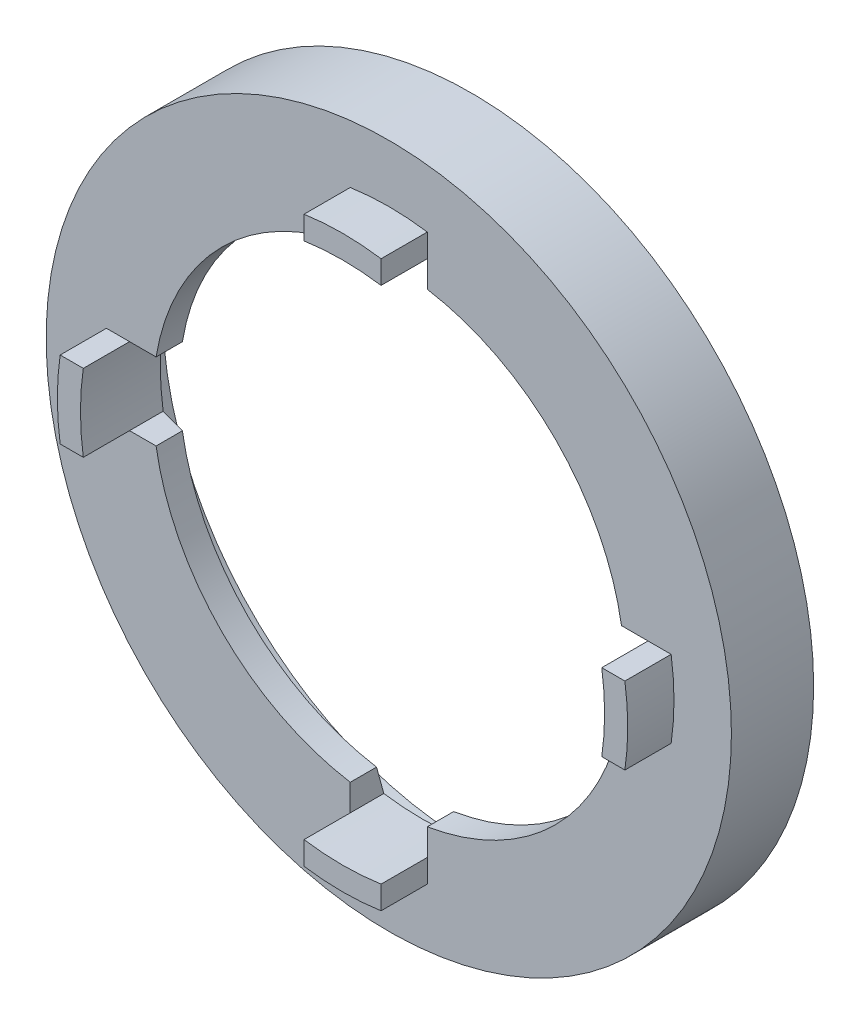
ISO-10303-21;
HEADER;
FILE_DESCRIPTION(('STEP AP214'),'2;1');
FILE_NAME('part.step','',(''),(''),'','','');
FILE_SCHEMA(('AUTOMOTIVE_DESIGN { 1 0 10303 214 1 1 1 1 }'));
ENDSEC;
DATA;
#1=APPLICATION_CONTEXT('core data for automotive mechanical design processes');
#2=APPLICATION_PROTOCOL_DEFINITION('international standard','automotive_design',2000,#1);
#3=PRODUCT_CONTEXT('',#1,'mechanical');
#4=PRODUCT('Part','Part','',(#3));
#5=PRODUCT_RELATED_PRODUCT_CATEGORY('part','',(#4));
#6=PRODUCT_DEFINITION_FORMATION('','',#4);
#7=PRODUCT_DEFINITION_CONTEXT('part definition',#1,'design');
#8=PRODUCT_DEFINITION('design','',#6,#7);
#9=PRODUCT_DEFINITION_SHAPE('','',#8);
#10=(LENGTH_UNIT() NAMED_UNIT(*) SI_UNIT(.MILLI.,.METRE.));
#11=(NAMED_UNIT(*) PLANE_ANGLE_UNIT() SI_UNIT($,.RADIAN.));
#12=(NAMED_UNIT(*) SI_UNIT($,.STERADIAN.) SOLID_ANGLE_UNIT());
#13=UNCERTAINTY_MEASURE_WITH_UNIT(LENGTH_MEASURE(1.E-05),#10,'distance_accuracy_value','');
#14=(GEOMETRIC_REPRESENTATION_CONTEXT(3) GLOBAL_UNCERTAINTY_ASSIGNED_CONTEXT((#13)) GLOBAL_UNIT_ASSIGNED_CONTEXT((#10,
#11,#12)) REPRESENTATION_CONTEXT('',''));
#15=CARTESIAN_POINT('',(0.,0.,0.));
#16=DIRECTION('',(0.,0.,1.));
#17=DIRECTION('',(1.,0.,0.));
#18=AXIS2_PLACEMENT_3D('',#15,#16,#17);
#19=CARTESIAN_POINT('',(0.,0.,-0.00100000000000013));
#20=DIRECTION('',(0.,0.,1.));
#21=DIRECTION('',(1.,0.,0.));
#22=AXIS2_PLACEMENT_3D('',#19,#20,#21);
#23=CYLINDRICAL_SURFACE('',#22,15.3);
#24=CARTESIAN_POINT('',(0.,0.,5.334));
#25=DIRECTION('',(0.,0.,1.));
#26=DIRECTION('',(1.,0.,0.));
#27=AXIS2_PLACEMENT_3D('',#24,#25,#26);
#28=CIRCLE('',#27,15.3);
#29=CARTESIAN_POINT('',(15.0943698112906,2.5,5.334));
#30=VERTEX_POINT('',#29);
#31=CARTESIAN_POINT('',(2.49999999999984,15.0943698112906,5.334));
#32=VERTEX_POINT('',#31);
#33=EDGE_CURVE('E445',#30,#32,#28,.T.);
#34=ORIENTED_EDGE('',*,*,#33,.T.);
#35=DIRECTION('',(0.,0.,1.));
#36=VECTOR('',#35,1.);
#37=CARTESIAN_POINT('',(2.49999999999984,15.0943698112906,0.));
#38=LINE('',#37,#36);
#39=CARTESIAN_POINT('',(2.49999999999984,15.0943698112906,3.62831139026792));
#40=VERTEX_POINT('',#39);
#41=EDGE_CURVE('E694',#40,#32,#38,.T.);
#42=ORIENTED_EDGE('',*,*,#41,.F.);
#43=CARTESIAN_POINT('',(0.,0.,3.62831139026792));
#44=DIRECTION('',(0.,0.,-1.));
#45=DIRECTION('',(-1.,0.,0.));
#46=AXIS2_PLACEMENT_3D('',#43,#44,#45);
#47=CIRCLE('',#46,15.3);
#48=CARTESIAN_POINT('',(15.0943698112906,2.5,3.62831139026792));
#49=VERTEX_POINT('',#48);
#50=EDGE_CURVE('E453',#49,#40,#47,.F.);
#51=ORIENTED_EDGE('',*,*,#50,.F.);
#52=DIRECTION('',(0.,0.,1.));
#53=VECTOR('',#52,1.);
#54=CARTESIAN_POINT('',(15.0943698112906,2.5,0.));
#55=LINE('',#54,#53);
#56=EDGE_CURVE('E677',#49,#30,#55,.T.);
#57=ORIENTED_EDGE('',*,*,#56,.T.);
#58=EDGE_LOOP('',(#34,#42,#51,#57));
#59=FACE_BOUND('',#58,.T.);
#60=ADVANCED_FACE('F35',(#59),#23,.F.);
#61=CARTESIAN_POINT('',(0.,0.,3.15641229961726));
#62=DIRECTION('',(0.,0.,-1.));
#63=DIRECTION('',(-1.,0.,0.));
#64=AXIS2_PLACEMENT_3D('',#61,#62,#63);
#65=CONICAL_SURFACE('',#64,17.,1.30002594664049);
#66=CARTESIAN_POINT('',(2.4999999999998,18.6386644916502,2.65520568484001));
#67=CARTESIAN_POINT('',(2.49999999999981,18.0913887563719,2.80576969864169));
#68=CARTESIAN_POINT('',(2.49999999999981,17.5440853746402,2.9562333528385));
#69=CARTESIAN_POINT('',(2.49999999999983,16.4493996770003,3.25687204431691));
#70=CARTESIAN_POINT('',(2.49999999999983,15.9020173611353,3.40704708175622));
#71=CARTESIAN_POINT('',(2.49999999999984,14.8071493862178,3.70702085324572));
#72=CARTESIAN_POINT('',(2.49999999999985,14.2596637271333,3.8568195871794));
#73=CARTESIAN_POINT('',(2.49999999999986,13.1645436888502,4.15587353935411));
#74=CARTESIAN_POINT('',(2.49999999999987,12.616909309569,4.30512875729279));
#75=CARTESIAN_POINT('',(2.49999999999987,12.0691781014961,4.45402855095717));
#76=B_SPLINE_CURVE_WITH_KNOTS('',3,(#66,#67,#68,#69,#70,#71,#72,#73,#74,#75),.UNSPECIFIED.,.F.,
.F.,(4,2,2,2,4),(0.,1.70282776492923,3.4056545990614,5.10848196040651,6.81131026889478),.UNSPECIFIED.);
#77=CARTESIAN_POINT('',(2.49999999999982,16.8151717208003,3.15641229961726));
#78=VERTEX_POINT('',#77);
#79=EDGE_CURVE('E530',#78,#40,#76,.T.);
#80=ORIENTED_EDGE('',*,*,#79,.F.);
#81=CARTESIAN_POINT('',(0.,0.,3.15641229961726));
#82=DIRECTION('',(0.,0.,1.));
#83=DIRECTION('',(1.,0.,0.));
#84=AXIS2_PLACEMENT_3D('',#81,#82,#83);
#85=CIRCLE('',#84,17.);
#86=CARTESIAN_POINT('',(16.8151717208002,2.5,3.15641229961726));
#87=VERTEX_POINT('',#86);
#88=EDGE_CURVE('E467',#87,#78,#85,.T.);
#89=ORIENTED_EDGE('',*,*,#88,.F.);
#90=CARTESIAN_POINT('',(12.069178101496,2.5,4.45402855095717));
#91=CARTESIAN_POINT('',(12.616909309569,2.5,4.30512875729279));
#92=CARTESIAN_POINT('',(13.1645436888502,2.5,4.15587353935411));
#93=CARTESIAN_POINT('',(14.2596637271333,2.5,3.8568195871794));
#94=CARTESIAN_POINT('',(14.8071493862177,2.5,3.70702085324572));
#95=CARTESIAN_POINT('',(15.9020173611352,2.5,3.40704708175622));
#96=CARTESIAN_POINT('',(16.4493996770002,2.5,3.25687204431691));
#97=CARTESIAN_POINT('',(17.5440853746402,2.5,2.9562333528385));
#98=CARTESIAN_POINT('',(18.0913887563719,2.5,2.80576969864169));
#99=CARTESIAN_POINT('',(18.6386644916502,2.5,2.65520568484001));
#100=B_SPLINE_CURVE_WITH_KNOTS('',3,(#90,#91,#92,#93,#94,#95,#96,#97,#98,#99),.UNSPECIFIED.,.F.,
.F.,(4,2,2,2,4),(0.,1.70282830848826,3.40565566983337,5.10848250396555,6.81131026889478),.UNSPECIFIED.);
#101=EDGE_CURVE('E528',#49,#87,#100,.T.);
#102=ORIENTED_EDGE('',*,*,#101,.F.);
#103=ORIENTED_EDGE('',*,*,#50,.T.);
#104=EDGE_LOOP('',(#80,#89,#102,#103));
#105=FACE_BOUND('',#104,.T.);
#106=ADVANCED_FACE('F396',(#105),#65,.F.);
#107=CARTESIAN_POINT('',(2.50000000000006,-15.0943698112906,5.334));
#108=VERTEX_POINT('',#107);
#109=CARTESIAN_POINT('',(15.0943698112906,-2.5,5.334));
#110=VERTEX_POINT('',#109);
#111=EDGE_CURVE('E441',#108,#110,#28,.T.);
#112=ORIENTED_EDGE('',*,*,#111,.T.);
#113=DIRECTION('',(0.,0.,1.));
#114=VECTOR('',#113,1.);
#115=CARTESIAN_POINT('',(15.0943698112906,-2.5,0.));
#116=LINE('',#115,#114);
#117=CARTESIAN_POINT('',(15.0943698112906,-2.5,3.62831139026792));
#118=VERTEX_POINT('',#117);
#119=EDGE_CURVE('E670',#118,#110,#116,.T.);
#120=ORIENTED_EDGE('',*,*,#119,.F.);
#121=CARTESIAN_POINT('',(2.50000000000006,-15.0943698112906,3.62831139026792));
#122=VERTEX_POINT('',#121);
#123=EDGE_CURVE('E448',#122,#118,#47,.F.);
#124=ORIENTED_EDGE('',*,*,#123,.F.);
#125=DIRECTION('',(0.,0.,1.));
#126=VECTOR('',#125,1.);
#127=CARTESIAN_POINT('',(2.50000000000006,-15.0943698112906,0.));
#128=LINE('',#127,#126);
#129=EDGE_CURVE('E584',#122,#108,#128,.T.);
#130=ORIENTED_EDGE('',*,*,#129,.T.);
#131=EDGE_LOOP('',(#112,#120,#124,#130));
#132=FACE_BOUND('',#131,.T.);
#133=ADVANCED_FACE('F402',(#132),#23,.F.);
#134=CARTESIAN_POINT('',(18.6386644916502,-2.5,2.65520568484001));
#135=CARTESIAN_POINT('',(18.0913887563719,-2.5,2.80576969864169));
#136=CARTESIAN_POINT('',(17.5440853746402,-2.5,2.9562333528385));
#137=CARTESIAN_POINT('',(16.4493996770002,-2.5,3.25687204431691));
#138=CARTESIAN_POINT('',(15.9020173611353,-2.5,3.40704708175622));
#139=CARTESIAN_POINT('',(14.8071493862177,-2.5,3.70702085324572));
#140=CARTESIAN_POINT('',(14.2596637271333,-2.5,3.8568195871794));
#141=CARTESIAN_POINT('',(13.1645436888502,-2.5,4.15587353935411));
#142=CARTESIAN_POINT('',(12.616909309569,-2.5,4.30512875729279));
#143=CARTESIAN_POINT('',(12.069178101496,-2.5,4.45402855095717));
#144=B_SPLINE_CURVE_WITH_KNOTS('',3,(#134,#135,#136,#137,#138,#139,#140,#141,#142,#143),
.UNSPECIFIED.,.F.,.F.,(4,2,2,2,4),(0.,1.70282776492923,3.4056545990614,5.10848196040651,
6.81131026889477),.UNSPECIFIED.);
#145=CARTESIAN_POINT('',(16.8151717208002,-2.5,3.15641229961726));
#146=VERTEX_POINT('',#145);
#147=EDGE_CURVE('E565',#146,#118,#144,.T.);
#148=ORIENTED_EDGE('',*,*,#147,.F.);
#149=CARTESIAN_POINT('',(2.50000000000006,-16.8151717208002,3.15641229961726));
#150=VERTEX_POINT('',#149);
#151=EDGE_CURVE('E518',#150,#146,#85,.T.);
#152=ORIENTED_EDGE('',*,*,#151,.F.);
#153=CARTESIAN_POINT('',(2.50000000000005,-13.2700954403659,4.1269882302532));
#154=CARTESIAN_POINT('',(2.50000000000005,-13.817692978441,3.9775984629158));
#155=CARTESIAN_POINT('',(2.50000000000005,-14.3652158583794,3.82793546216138));
#156=CARTESIAN_POINT('',(2.50000000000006,-15.4601451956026,3.52818488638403));
#157=CARTESIAN_POINT('',(2.50000000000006,-16.0075516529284,3.37809731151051));
#158=CARTESIAN_POINT('',(2.50000000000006,-17.1022813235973,3.07761940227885));
#159=CARTESIAN_POINT('',(2.50000000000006,-17.6496045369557,2.92722906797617));
#160=CARTESIAN_POINT('',(2.50000000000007,-18.7441863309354,2.62621261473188));
#161=CARTESIAN_POINT('',(2.50000000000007,-19.2914449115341,2.47558649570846));
#162=CARTESIAN_POINT('',(2.50000000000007,-19.8386802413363,2.3248760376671));
#163=B_SPLINE_CURVE_WITH_KNOTS('',3,(#153,#154,#155,#156,#157,#158,#159,#160,#161,#162),
.UNSPECIFIED.,.F.,.F.,(4,2,2,2,4),(0.,1.70282779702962,3.40565499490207,5.10848188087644,
6.81130935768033),.UNSPECIFIED.);
#164=EDGE_CURVE('E582',#122,#150,#163,.T.);
#165=ORIENTED_EDGE('',*,*,#164,.F.);
#166=ORIENTED_EDGE('',*,*,#123,.T.);
#167=EDGE_LOOP('',(#148,#152,#165,#166));
#168=FACE_BOUND('',#167,.T.);
#169=ADVANCED_FACE('F408',(#168),#65,.F.);
#170=CARTESIAN_POINT('',(-15.0943698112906,-2.5,5.334));
#171=VERTEX_POINT('',#170);
#172=CARTESIAN_POINT('',(-2.49999999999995,-15.0943698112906,5.334));
#173=VERTEX_POINT('',#172);
#174=EDGE_CURVE('E435',#171,#173,#28,.T.);
#175=ORIENTED_EDGE('',*,*,#174,.T.);
#176=DIRECTION('',(0.,0.,1.));
#177=VECTOR('',#176,1.);
#178=CARTESIAN_POINT('',(-2.49999999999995,-15.0943698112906,0.));
#179=LINE('',#178,#177);
#180=CARTESIAN_POINT('',(-2.49999999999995,-15.0943698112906,3.62831139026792));
#181=VERTEX_POINT('',#180);
#182=EDGE_CURVE('E437',#181,#173,#179,.T.);
#183=ORIENTED_EDGE('',*,*,#182,.F.);
#184=CARTESIAN_POINT('',(-15.0943698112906,-2.5,3.62831139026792));
#185=VERTEX_POINT('',#184);
#186=EDGE_CURVE('E39',#185,#181,#47,.F.);
#187=ORIENTED_EDGE('',*,*,#186,.F.);
#188=DIRECTION('',(0.,0.,1.));
#189=VECTOR('',#188,1.);
#190=CARTESIAN_POINT('',(-15.0943698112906,-2.5,0.));
#191=LINE('',#190,#189);
#192=EDGE_CURVE('E337',#185,#171,#191,.T.);
#193=ORIENTED_EDGE('',*,*,#192,.T.);
#194=EDGE_LOOP('',(#175,#183,#187,#193));
#195=FACE_BOUND('',#194,.T.);
#196=ADVANCED_FACE('F413',(#195),#23,.F.);
#197=CARTESIAN_POINT('',(-2.49999999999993,-19.8386802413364,2.3248760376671));
#198=CARTESIAN_POINT('',(-2.49999999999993,-19.2914449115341,2.47558649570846));
#199=CARTESIAN_POINT('',(-2.49999999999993,-18.7441863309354,2.62621261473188));
#200=CARTESIAN_POINT('',(-2.49999999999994,-17.6496045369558,2.92722906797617));
#201=CARTESIAN_POINT('',(-2.49999999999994,-17.1022813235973,3.07761940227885));
#202=CARTESIAN_POINT('',(-2.49999999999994,-16.0075516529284,3.37809731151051));
#203=CARTESIAN_POINT('',(-2.49999999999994,-15.4601451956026,3.52818488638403));
#204=CARTESIAN_POINT('',(-2.49999999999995,-14.3652158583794,3.82793546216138));
#205=CARTESIAN_POINT('',(-2.49999999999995,-13.817692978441,3.9775984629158));
#206=CARTESIAN_POINT('',(-2.49999999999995,-13.2700954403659,4.1269882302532));
#207=B_SPLINE_CURVE_WITH_KNOTS('',3,(#197,#198,#199,#200,#201,#202,#203,#204,#205,#206),
.UNSPECIFIED.,.F.,.F.,(4,2,2,2,4),(0.,1.70282747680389,3.40565436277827,5.10848156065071,
6.81130935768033),.UNSPECIFIED.);
#208=CARTESIAN_POINT('',(-2.49999999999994,-16.8151717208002,3.15641229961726));
#209=VERTEX_POINT('',#208);
#210=EDGE_CURVE('E513',#209,#181,#207,.T.);
#211=ORIENTED_EDGE('',*,*,#210,.F.);
#212=CARTESIAN_POINT('',(-16.8151717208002,-2.5,3.15641229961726));
#213=VERTEX_POINT('',#212);
#214=EDGE_CURVE('E458',#213,#209,#85,.T.);
#215=ORIENTED_EDGE('',*,*,#214,.F.);
#216=CARTESIAN_POINT('',(-13.2700954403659,-2.5,4.12698823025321));
#217=CARTESIAN_POINT('',(-13.817692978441,-2.5,3.9775984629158));
#218=CARTESIAN_POINT('',(-14.3652158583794,-2.5,3.82793546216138));
#219=CARTESIAN_POINT('',(-15.4601451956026,-2.5,3.52818488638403));
#220=CARTESIAN_POINT('',(-16.0075516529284,-2.5,3.37809731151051));
#221=CARTESIAN_POINT('',(-17.1022813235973,-2.5,3.07761940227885));
#222=CARTESIAN_POINT('',(-17.6496045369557,-2.5,2.92722906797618));
#223=CARTESIAN_POINT('',(-18.7441863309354,-2.5,2.62621261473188));
#224=CARTESIAN_POINT('',(-19.2914449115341,-2.5,2.47558649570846));
#225=CARTESIAN_POINT('',(-19.8386802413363,-2.5,2.3248760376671));
#226=B_SPLINE_CURVE_WITH_KNOTS('',3,(#216,#217,#218,#219,#220,#221,#222,#223,#224,#225),
.UNSPECIFIED.,.F.,.F.,(4,2,2,2,4),(0.,1.70282779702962,3.40565499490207,5.10848188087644,
6.81130935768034),.UNSPECIFIED.);
#227=EDGE_CURVE('E333',#185,#213,#226,.T.);
#228=ORIENTED_EDGE('',*,*,#227,.F.);
#229=ORIENTED_EDGE('',*,*,#186,.T.);
#230=EDGE_LOOP('',(#211,#215,#228,#229));
#231=FACE_BOUND('',#230,.T.);
#232=ADVANCED_FACE('F397',(#231),#65,.F.);
#233=CARTESIAN_POINT('',(0.,0.,5.334));
#234=DIRECTION('',(0.,0.,1.));
#235=DIRECTION('',(1.,0.,0.));
#236=AXIS2_PLACEMENT_3D('',#233,#234,#235);
#237=PLANE('',#236);
#238=DIRECTION('',(0.,1.,0.));
#239=VECTOR('',#238,1.);
#240=CARTESIAN_POINT('',(2.49999999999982,16.8151717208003,5.334));
#241=LINE('',#240,#239);
#242=CARTESIAN_POINT('',(2.49999999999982,16.8151717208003,5.334));
#243=VERTEX_POINT('',#242);
#244=EDGE_CURVE('E236',#32,#243,#241,.T.);
#245=ORIENTED_EDGE('',*,*,#244,.F.);
#246=ORIENTED_EDGE('',*,*,#33,.F.);
#247=DIRECTION('',(-1.,0.,0.));
#248=VECTOR('',#247,1.);
#249=CARTESIAN_POINT('',(16.8151717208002,2.5,5.334));
#250=LINE('',#249,#248);
#251=CARTESIAN_POINT('',(16.8151717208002,2.5,5.334));
#252=VERTEX_POINT('',#251);
#253=EDGE_CURVE('E534',#252,#30,#250,.T.);
#254=ORIENTED_EDGE('',*,*,#253,.F.);
#255=DIRECTION('',(-1.,0.,0.));
#256=VECTOR('',#255,1.);
#257=CARTESIAN_POINT('',(18.3151717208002,2.5,5.334));
#258=LINE('',#257,#256);
#259=CARTESIAN_POINT('',(18.3151717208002,2.5,5.334));
#260=VERTEX_POINT('',#259);
#261=EDGE_CURVE('E277',#260,#252,#258,.T.);
#262=ORIENTED_EDGE('',*,*,#261,.F.);
#263=CARTESIAN_POINT('',(1.5,0.,5.334));
#264=DIRECTION('',(0.,0.,1.));
#265=DIRECTION('',(1.,0.,0.));
#266=AXIS2_PLACEMENT_3D('',#263,#264,#265);
#267=CIRCLE('',#266,17.);
#268=CARTESIAN_POINT('',(18.3151717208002,-2.5,5.334));
#269=VERTEX_POINT('',#268);
#270=EDGE_CURVE('E285',#269,#260,#267,.T.);
#271=ORIENTED_EDGE('',*,*,#270,.F.);
#272=DIRECTION('',(1.,0.,0.));
#273=VECTOR('',#272,1.);
#274=CARTESIAN_POINT('',(18.3151717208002,-2.5,5.334));
#275=LINE('',#274,#273);
#276=CARTESIAN_POINT('',(16.8151717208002,-2.5,5.334));
#277=VERTEX_POINT('',#276);
#278=EDGE_CURVE('E272',#277,#269,#275,.T.);
#279=ORIENTED_EDGE('',*,*,#278,.F.);
#280=DIRECTION('',(1.,0.,0.));
#281=VECTOR('',#280,1.);
#282=CARTESIAN_POINT('',(16.8151717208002,-2.5,5.334));
#283=LINE('',#282,#281);
#284=EDGE_CURVE('E536',#110,#277,#283,.T.);
#285=ORIENTED_EDGE('',*,*,#284,.F.);
#286=ORIENTED_EDGE('',*,*,#111,.F.);
#287=DIRECTION('',(0.,1.,0.));
#288=VECTOR('',#287,1.);
#289=CARTESIAN_POINT('',(2.50000000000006,-16.8151717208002,5.334));
#290=LINE('',#289,#288);
#291=CARTESIAN_POINT('',(2.50000000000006,-16.8151717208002,5.334));
#292=VERTEX_POINT('',#291);
#293=EDGE_CURVE('E571',#292,#108,#290,.T.);
#294=ORIENTED_EDGE('',*,*,#293,.F.);
#295=DIRECTION('',(0.,1.,0.));
#296=VECTOR('',#295,1.);
#297=CARTESIAN_POINT('',(2.50000000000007,-18.3151717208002,5.334));
#298=LINE('',#297,#296);
#299=CARTESIAN_POINT('',(2.50000000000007,-18.3151717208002,5.334));
#300=VERTEX_POINT('',#299);
#301=EDGE_CURVE('E302',#300,#292,#298,.T.);
#302=ORIENTED_EDGE('',*,*,#301,.F.);
#303=CARTESIAN_POINT('',(0.,-1.5,5.334));
#304=DIRECTION('',(0.,0.,1.));
#305=DIRECTION('',(0.,-1.,0.));
#306=AXIS2_PLACEMENT_3D('',#303,#304,#305);
#307=CIRCLE('',#306,17.);
#308=CARTESIAN_POINT('',(-2.49999999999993,-18.3151717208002,5.334));
#309=VERTEX_POINT('',#308);
#310=EDGE_CURVE('E310',#309,#300,#307,.T.);
#311=ORIENTED_EDGE('',*,*,#310,.F.);
#312=DIRECTION('',(0.,-1.,0.));
#313=VECTOR('',#312,1.);
#314=CARTESIAN_POINT('',(-2.49999999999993,-18.3151717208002,5.334));
#315=LINE('',#314,#313);
#316=CARTESIAN_POINT('',(-2.49999999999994,-16.8151717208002,5.334));
#317=VERTEX_POINT('',#316);
#318=EDGE_CURVE('E297',#317,#309,#315,.T.);
#319=ORIENTED_EDGE('',*,*,#318,.F.);
#320=DIRECTION('',(0.,-1.,0.));
#321=VECTOR('',#320,1.);
#322=CARTESIAN_POINT('',(-2.49999999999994,-16.8151717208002,5.334));
#323=LINE('',#322,#321);
#324=EDGE_CURVE('E577',#173,#317,#323,.T.);
#325=ORIENTED_EDGE('',*,*,#324,.F.);
#326=ORIENTED_EDGE('',*,*,#174,.F.);
#327=DIRECTION('',(1.,0.,0.));
#328=VECTOR('',#327,1.);
#329=CARTESIAN_POINT('',(-16.8151717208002,-2.5,5.334));
#330=LINE('',#329,#328);
#331=CARTESIAN_POINT('',(-16.8151717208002,-2.5,5.334));
#332=VERTEX_POINT('',#331);
#333=EDGE_CURVE('E325',#332,#171,#330,.T.);
#334=ORIENTED_EDGE('',*,*,#333,.F.);
#335=DIRECTION('',(1.,0.,0.));
#336=VECTOR('',#335,1.);
#337=CARTESIAN_POINT('',(-18.3151717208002,-2.5,5.334));
#338=LINE('',#337,#336);
#339=CARTESIAN_POINT('',(-18.3151717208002,-2.5,5.334));
#340=VERTEX_POINT('',#339);
#341=EDGE_CURVE('E486',#340,#332,#338,.T.);
#342=ORIENTED_EDGE('',*,*,#341,.F.);
#343=CARTESIAN_POINT('',(-1.5,0.,5.334));
#344=DIRECTION('',(0.,0.,1.));
#345=DIRECTION('',(-1.,0.,0.));
#346=AXIS2_PLACEMENT_3D('',#343,#344,#345);
#347=CIRCLE('',#346,17.);
#348=CARTESIAN_POINT('',(-18.3151717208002,2.5,5.334));
#349=VERTEX_POINT('',#348);
#350=EDGE_CURVE('E490',#349,#340,#347,.T.);
#351=ORIENTED_EDGE('',*,*,#350,.F.);
#352=DIRECTION('',(-1.,0.,0.));
#353=VECTOR('',#352,1.);
#354=CARTESIAN_POINT('',(-18.3151717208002,2.5,5.334));
#355=LINE('',#354,#353);
#356=CARTESIAN_POINT('',(-16.8151717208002,2.5,5.334));
#357=VERTEX_POINT('',#356);
#358=EDGE_CURVE('E493',#357,#349,#355,.T.);
#359=ORIENTED_EDGE('',*,*,#358,.F.);
#360=DIRECTION('',(-1.,0.,0.));
#361=VECTOR('',#360,1.);
#362=CARTESIAN_POINT('',(-16.8151717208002,2.5,5.334));
#363=LINE('',#362,#361);
#364=CARTESIAN_POINT('',(-15.0943698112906,2.5,5.334));
#365=VERTEX_POINT('',#364);
#366=EDGE_CURVE('E327',#365,#357,#363,.T.);
#367=ORIENTED_EDGE('',*,*,#366,.F.);
#368=CARTESIAN_POINT('',(-2.50000000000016,15.0943698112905,5.334));
#369=VERTEX_POINT('',#368);
#370=EDGE_CURVE('E247',#369,#365,#28,.T.);
#371=ORIENTED_EDGE('',*,*,#370,.F.);
#372=DIRECTION('',(0.,-1.,0.));
#373=VECTOR('',#372,1.);
#374=CARTESIAN_POINT('',(-2.50000000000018,16.8151717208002,5.334));
#375=LINE('',#374,#373);
#376=CARTESIAN_POINT('',(-2.50000000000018,16.8151717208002,5.334));
#377=VERTEX_POINT('',#376);
#378=EDGE_CURVE('E228',#377,#369,#375,.T.);
#379=ORIENTED_EDGE('',*,*,#378,.F.);
#380=DIRECTION('',(0.,-1.,0.));
#381=VECTOR('',#380,1.);
#382=CARTESIAN_POINT('',(-2.50000000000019,18.3151717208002,5.334));
#383=LINE('',#382,#381);
#384=CARTESIAN_POINT('',(-2.50000000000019,18.3151717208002,5.334));
#385=VERTEX_POINT('',#384);
#386=EDGE_CURVE('E245',#385,#377,#383,.T.);
#387=ORIENTED_EDGE('',*,*,#386,.F.);
#388=CARTESIAN_POINT('',(0.,1.5,5.334));
#389=DIRECTION('',(0.,0.,1.));
#390=DIRECTION('',(0.,1.,0.));
#391=AXIS2_PLACEMENT_3D('',#388,#389,#390);
#392=CIRCLE('',#391,17.);
#393=CARTESIAN_POINT('',(2.49999999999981,18.3151717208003,5.334));
#394=VERTEX_POINT('',#393);
#395=EDGE_CURVE('E254',#394,#385,#392,.T.);
#396=ORIENTED_EDGE('',*,*,#395,.F.);
#397=DIRECTION('',(0.,1.,0.));
#398=VECTOR('',#397,1.);
#399=CARTESIAN_POINT('',(2.49999999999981,18.3151717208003,5.334));
#400=LINE('',#399,#398);
#401=EDGE_CURVE('E701',#243,#394,#400,.T.);
#402=ORIENTED_EDGE('',*,*,#401,.F.);
#403=EDGE_LOOP('',(#245,#246,#254,#262,#271,#279,#285,#286,#294,#302,#311,#319,#325,#326,#334,
#342,#351,#359,#367,#371,#379,#387,#396,#402));
#404=FACE_BOUND('',#403,.T.);
#405=CARTESIAN_POINT('',(0.,0.,5.334));
#406=DIRECTION('',(0.,0.,1.));
#407=DIRECTION('',(1.,0.,0.));
#408=AXIS2_PLACEMENT_3D('',#405,#406,#407);
#409=CIRCLE('',#408,22.225);
#410=CARTESIAN_POINT('',(22.225,0.,5.334));
#411=VERTEX_POINT('',#410);
#412=EDGE_CURVE('E11',#411,#411,#409,.T.);
#413=ORIENTED_EDGE('',*,*,#412,.T.);
#414=EDGE_LOOP('',(#413));
#415=FACE_BOUND('',#414,.T.);
#416=ADVANCED_FACE('F242',(#404,#415),#237,.T.);
#417=CARTESIAN_POINT('',(0.,0.,0.));
#418=DIRECTION('',(0.,0.,1.));
#419=DIRECTION('',(1.,0.,0.));
#420=AXIS2_PLACEMENT_3D('',#417,#418,#419);
#421=PLANE('',#420);
#422=CARTESIAN_POINT('',(0.,0.,0.));
#423=DIRECTION('',(0.,0.,1.));
#424=DIRECTION('',(1.,0.,0.));
#425=AXIS2_PLACEMENT_3D('',#422,#423,#424);
#426=CIRCLE('',#425,22.225);
#427=CARTESIAN_POINT('',(22.225,0.,0.));
#428=VERTEX_POINT('',#427);
#429=EDGE_CURVE('E44',#428,#428,#426,.T.);
#430=ORIENTED_EDGE('',*,*,#429,.F.);
#431=EDGE_LOOP('',(#430));
#432=FACE_BOUND('',#431,.T.);
#433=CARTESIAN_POINT('',(0.,0.,0.));
#434=DIRECTION('',(0.,0.,1.));
#435=DIRECTION('',(1.,0.,0.));
#436=AXIS2_PLACEMENT_3D('',#433,#434,#435);
#437=CIRCLE('',#436,20.);
#438=CARTESIAN_POINT('',(20.,0.,0.));
#439=VERTEX_POINT('',#438);
#440=EDGE_CURVE('E469',#439,#439,#437,.T.);
#441=ORIENTED_EDGE('',*,*,#440,.T.);
#442=EDGE_LOOP('',(#441));
#443=FACE_BOUND('',#442,.T.);
#444=ADVANCED_FACE('F415',(#432,#443),#421,.F.);
#445=CARTESIAN_POINT('',(-2.50000000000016,15.0943698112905,3.62831139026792));
#446=VERTEX_POINT('',#445);
#447=CARTESIAN_POINT('',(-15.0943698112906,2.5,3.62831139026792));
#448=VERTEX_POINT('',#447);
#449=EDGE_CURVE('E449',#446,#448,#47,.F.);
#450=ORIENTED_EDGE('',*,*,#449,.F.);
#451=DIRECTION('',(0.,0.,1.));
#452=VECTOR('',#451,1.);
#453=CARTESIAN_POINT('',(-2.50000000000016,15.0943698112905,0.));
#454=LINE('',#453,#452);
#455=EDGE_CURVE('E235',#446,#369,#454,.T.);
#456=ORIENTED_EDGE('',*,*,#455,.T.);
#457=ORIENTED_EDGE('',*,*,#370,.T.);
#458=DIRECTION('',(0.,0.,1.));
#459=VECTOR('',#458,1.);
#460=CARTESIAN_POINT('',(-15.0943698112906,2.5,0.));
#461=LINE('',#460,#459);
#462=EDGE_CURVE('E334',#448,#365,#461,.T.);
#463=ORIENTED_EDGE('',*,*,#462,.F.);
#464=EDGE_LOOP('',(#450,#456,#457,#463));
#465=FACE_BOUND('',#464,.T.);
#466=ADVANCED_FACE('F403',(#465),#23,.F.);
#467=CARTESIAN_POINT('',(0.,0.,5.334));
#468=DIRECTION('',(0.,0.,-1.));
#469=DIRECTION('',(-1.,0.,0.));
#470=AXIS2_PLACEMENT_3D('',#467,#468,#469);
#471=CYLINDRICAL_SURFACE('',#470,22.225);
#472=ORIENTED_EDGE('',*,*,#412,.F.);
#473=EDGE_LOOP('',(#472));
#474=FACE_BOUND('',#473,.T.);
#475=ORIENTED_EDGE('',*,*,#429,.T.);
#476=EDGE_LOOP('',(#475));
#477=FACE_BOUND('',#476,.T.);
#478=ADVANCED_FACE('F37',(#474,#477),#471,.T.);
#479=CARTESIAN_POINT('',(-2.50000000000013,12.069178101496,4.45402855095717));
#480=CARTESIAN_POINT('',(-2.50000000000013,12.616909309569,4.30512875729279));
#481=CARTESIAN_POINT('',(-2.50000000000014,13.1645436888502,4.15587353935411));
#482=CARTESIAN_POINT('',(-2.50000000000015,14.2596637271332,3.8568195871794));
#483=CARTESIAN_POINT('',(-2.50000000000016,14.8071493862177,3.70702085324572));
#484=CARTESIAN_POINT('',(-2.50000000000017,15.9020173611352,3.40704708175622));
#485=CARTESIAN_POINT('',(-2.50000000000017,16.4493996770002,3.25687204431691));
#486=CARTESIAN_POINT('',(-2.50000000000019,17.5440853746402,2.9562333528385));
#487=CARTESIAN_POINT('',(-2.50000000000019,18.0913887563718,2.80576969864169));
#488=CARTESIAN_POINT('',(-2.5000000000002,18.6386644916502,2.65520568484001));
#489=B_SPLINE_CURVE_WITH_KNOTS('',3,(#479,#480,#481,#482,#483,#484,#485,#486,#487,#488),
.UNSPECIFIED.,.F.,.F.,(4,2,2,2,4),(0.,1.70282830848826,3.40565566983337,5.10848250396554,
6.81131026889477),.UNSPECIFIED.);
#490=CARTESIAN_POINT('',(-2.50000000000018,16.8151717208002,3.15641229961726));
#491=VERTEX_POINT('',#490);
#492=EDGE_CURVE('E231',#446,#491,#489,.T.);
#493=ORIENTED_EDGE('',*,*,#492,.F.);
#494=ORIENTED_EDGE('',*,*,#449,.T.);
#495=CARTESIAN_POINT('',(-19.8386802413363,2.5,2.3248760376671));
#496=CARTESIAN_POINT('',(-19.2914449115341,2.5,2.47558649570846));
#497=CARTESIAN_POINT('',(-18.7441863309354,2.5,2.62621261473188));
#498=CARTESIAN_POINT('',(-17.6496045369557,2.5,2.92722906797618));
#499=CARTESIAN_POINT('',(-17.1022813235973,2.5,3.07761940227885));
#500=CARTESIAN_POINT('',(-16.0075516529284,2.5,3.37809731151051));
#501=CARTESIAN_POINT('',(-15.4601451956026,2.5,3.52818488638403));
#502=CARTESIAN_POINT('',(-14.3652158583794,2.5,3.82793546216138));
#503=CARTESIAN_POINT('',(-13.817692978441,2.5,3.9775984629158));
#504=CARTESIAN_POINT('',(-13.2700954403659,2.5,4.1269882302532));
#505=B_SPLINE_CURVE_WITH_KNOTS('',3,(#495,#496,#497,#498,#499,#500,#501,#502,#503,#504),
.UNSPECIFIED.,.F.,.F.,(4,2,2,2,4),(0.,1.70282747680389,3.40565436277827,5.10848156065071,
6.81130935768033),.UNSPECIFIED.);
#506=CARTESIAN_POINT('',(-16.8151717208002,2.5,3.15641229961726));
#507=VERTEX_POINT('',#506);
#508=EDGE_CURVE('E347',#507,#448,#505,.T.);
#509=ORIENTED_EDGE('',*,*,#508,.F.);
#510=EDGE_CURVE('E459',#491,#507,#85,.T.);
#511=ORIENTED_EDGE('',*,*,#510,.F.);
#512=EDGE_LOOP('',(#493,#494,#509,#511));
#513=FACE_BOUND('',#512,.T.);
#514=ADVANCED_FACE('F353',(#513),#65,.F.);
#515=CARTESIAN_POINT('',(-17.,0.,3.15641229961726));
#516=DIRECTION('',(0.,0.,-1.));
#517=DIRECTION('',(-1.,0.,0.));
#518=AXIS2_PLACEMENT_3D('',#515,#516,#517);
#519=PLANE('',#518);
#520=EDGE_CURVE('E454',#507,#213,#85,.T.);
#521=ORIENTED_EDGE('',*,*,#520,.T.);
#522=ORIENTED_EDGE('',*,*,#214,.T.);
#523=EDGE_CURVE('E462',#209,#150,#85,.T.);
#524=ORIENTED_EDGE('',*,*,#523,.T.);
#525=ORIENTED_EDGE('',*,*,#151,.T.);
#526=EDGE_CURVE('E523',#146,#87,#85,.T.);
#527=ORIENTED_EDGE('',*,*,#526,.T.);
#528=ORIENTED_EDGE('',*,*,#88,.T.);
#529=EDGE_CURVE('E464',#78,#491,#85,.T.);
#530=ORIENTED_EDGE('',*,*,#529,.T.);
#531=ORIENTED_EDGE('',*,*,#510,.T.);
#532=EDGE_LOOP('',(#521,#522,#524,#525,#527,#528,#530,#531));
#533=FACE_BOUND('',#532,.T.);
#534=CARTESIAN_POINT('',(0.,0.,3.15641229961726));
#535=DIRECTION('',(0.,0.,1.));
#536=DIRECTION('',(1.,0.,0.));
#537=AXIS2_PLACEMENT_3D('',#534,#535,#536);
#538=CIRCLE('',#537,20.);
#539=CARTESIAN_POINT('',(20.,0.,3.15641229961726));
#540=VERTEX_POINT('',#539);
#541=EDGE_CURVE('E465',#540,#540,#538,.T.);
#542=ORIENTED_EDGE('',*,*,#541,.F.);
#543=EDGE_LOOP('',(#542));
#544=FACE_BOUND('',#543,.T.);
#545=ADVANCED_FACE('F388',(#533,#544),#519,.T.);
#546=CARTESIAN_POINT('',(0.,0.,-1.424421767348));
#547=DIRECTION('',(0.,0.,1.));
#548=DIRECTION('',(1.,0.,0.));
#549=AXIS2_PLACEMENT_3D('',#546,#547,#548);
#550=CYLINDRICAL_SURFACE('',#549,20.);
#551=ORIENTED_EDGE('',*,*,#541,.T.);
#552=EDGE_LOOP('',(#551));
#553=FACE_BOUND('',#552,.T.);
#554=ORIENTED_EDGE('',*,*,#440,.F.);
#555=EDGE_LOOP('',(#554));
#556=FACE_BOUND('',#555,.T.);
#557=ADVANCED_FACE('F385',(#553,#556),#550,.F.);
#558=CARTESIAN_POINT('',(0.,0.,8.334));
#559=DIRECTION('',(0.,0.,-1.));
#560=DIRECTION('',(-1.,0.,0.));
#561=AXIS2_PLACEMENT_3D('',#558,#559,#560);
#562=CYLINDRICAL_SURFACE('',#561,17.);
#563=DIRECTION('',(0.,0.,-1.));
#564=VECTOR('',#563,1.);
#565=CARTESIAN_POINT('',(-16.8151717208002,-2.5,8.334));
#566=LINE('',#565,#564);
#567=CARTESIAN_POINT('',(-16.8151717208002,-2.5,8.334));
#568=VERTEX_POINT('',#567);
#569=EDGE_CURVE('E482',#568,#332,#566,.T.);
#570=ORIENTED_EDGE('',*,*,#569,.T.);
#571=DIRECTION('',(0.,0.,1.));
#572=VECTOR('',#571,1.);
#573=CARTESIAN_POINT('',(-16.8151717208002,-2.5,0.));
#574=LINE('',#573,#572);
#575=EDGE_CURVE('E329',#213,#332,#574,.T.);
#576=ORIENTED_EDGE('',*,*,#575,.F.);
#577=ORIENTED_EDGE('',*,*,#520,.F.);
#578=DIRECTION('',(0.,0.,1.));
#579=VECTOR('',#578,1.);
#580=CARTESIAN_POINT('',(-16.8151717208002,2.5,0.));
#581=LINE('',#580,#579);
#582=EDGE_CURVE('E330',#507,#357,#581,.T.);
#583=ORIENTED_EDGE('',*,*,#582,.T.);
#584=DIRECTION('',(0.,0.,-1.));
#585=VECTOR('',#584,1.);
#586=CARTESIAN_POINT('',(-16.8151717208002,2.5,8.334));
#587=LINE('',#586,#585);
#588=CARTESIAN_POINT('',(-16.8151717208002,2.5,8.334));
#589=VERTEX_POINT('',#588);
#590=EDGE_CURVE('E472',#589,#357,#587,.T.);
#591=ORIENTED_EDGE('',*,*,#590,.F.);
#592=CARTESIAN_POINT('',(0.,0.,8.334));
#593=DIRECTION('',(0.,0.,-1.));
#594=DIRECTION('',(1.,0.,0.));
#595=AXIS2_PLACEMENT_3D('',#592,#593,#594);
#596=CIRCLE('',#595,17.);
#597=EDGE_CURVE('E489',#568,#589,#596,.T.);
#598=ORIENTED_EDGE('',*,*,#597,.F.);
#599=EDGE_LOOP('',(#570,#576,#577,#583,#591,#598));
#600=FACE_BOUND('',#599,.T.);
#601=ADVANCED_FACE('F381',(#600),#562,.F.);
#602=CARTESIAN_POINT('',(-18.3151717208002,2.5,8.334));
#603=DIRECTION('',(0.,-1.,0.));
#604=DIRECTION('',(0.,0.,-1.));
#605=AXIS2_PLACEMENT_3D('',#602,#603,#604);
#606=PLANE('',#605);
#607=ORIENTED_EDGE('',*,*,#358,.T.);
#608=DIRECTION('',(0.,0.,-1.));
#609=VECTOR('',#608,1.);
#610=CARTESIAN_POINT('',(-18.3151717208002,2.5,8.334));
#611=LINE('',#610,#609);
#612=CARTESIAN_POINT('',(-18.3151717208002,2.5,8.334));
#613=VERTEX_POINT('',#612);
#614=EDGE_CURVE('E477',#613,#349,#611,.T.);
#615=ORIENTED_EDGE('',*,*,#614,.F.);
#616=DIRECTION('',(-1.,0.,0.));
#617=VECTOR('',#616,1.);
#618=CARTESIAN_POINT('',(-18.3151717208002,2.5,8.334));
#619=LINE('',#618,#617);
#620=EDGE_CURVE('E498',#589,#613,#619,.T.);
#621=ORIENTED_EDGE('',*,*,#620,.F.);
#622=ORIENTED_EDGE('',*,*,#590,.T.);
#623=EDGE_LOOP('',(#607,#615,#621,#622));
#624=FACE_BOUND('',#623,.T.);
#625=ADVANCED_FACE('F377',(#624),#606,.F.);
#626=CARTESIAN_POINT('',(-1.5,0.,8.334));
#627=DIRECTION('',(0.,0.,-1.));
#628=DIRECTION('',(-1.,0.,0.));
#629=AXIS2_PLACEMENT_3D('',#626,#627,#628);
#630=CYLINDRICAL_SURFACE('',#629,17.);
#631=ORIENTED_EDGE('',*,*,#350,.T.);
#632=DIRECTION('',(0.,0.,-1.));
#633=VECTOR('',#632,1.);
#634=CARTESIAN_POINT('',(-18.3151717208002,-2.5,8.334));
#635=LINE('',#634,#633);
#636=CARTESIAN_POINT('',(-18.3151717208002,-2.5,8.334));
#637=VERTEX_POINT('',#636);
#638=EDGE_CURVE('E480',#637,#340,#635,.T.);
#639=ORIENTED_EDGE('',*,*,#638,.F.);
#640=CARTESIAN_POINT('',(-1.5,0.,8.334));
#641=DIRECTION('',(0.,0.,1.));
#642=DIRECTION('',(-1.,0.,0.));
#643=AXIS2_PLACEMENT_3D('',#640,#641,#642);
#644=CIRCLE('',#643,17.);
#645=EDGE_CURVE('E496',#613,#637,#644,.T.);
#646=ORIENTED_EDGE('',*,*,#645,.F.);
#647=ORIENTED_EDGE('',*,*,#614,.T.);
#648=EDGE_LOOP('',(#631,#639,#646,#647));
#649=FACE_BOUND('',#648,.T.);
#650=ADVANCED_FACE('F373',(#649),#630,.T.);
#651=CARTESIAN_POINT('',(-18.3151717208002,-2.5,8.334));
#652=DIRECTION('',(0.,1.,0.));
#653=DIRECTION('',(0.,0.,1.));
#654=AXIS2_PLACEMENT_3D('',#651,#652,#653);
#655=PLANE('',#654);
#656=ORIENTED_EDGE('',*,*,#341,.T.);
#657=ORIENTED_EDGE('',*,*,#569,.F.);
#658=DIRECTION('',(1.,0.,0.));
#659=VECTOR('',#658,1.);
#660=CARTESIAN_POINT('',(-18.3151717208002,-2.5,8.334));
#661=LINE('',#660,#659);
#662=EDGE_CURVE('E485',#637,#568,#661,.T.);
#663=ORIENTED_EDGE('',*,*,#662,.F.);
#664=ORIENTED_EDGE('',*,*,#638,.T.);
#665=EDGE_LOOP('',(#656,#657,#663,#664));
#666=FACE_BOUND('',#665,.T.);
#667=ADVANCED_FACE('F369',(#666),#655,.F.);
#668=CARTESIAN_POINT('',(0.,0.,8.334));
#669=DIRECTION('',(0.,0.,1.));
#670=DIRECTION('',(1.,0.,0.));
#671=AXIS2_PLACEMENT_3D('',#668,#669,#670);
#672=PLANE('',#671);
#673=ORIENTED_EDGE('',*,*,#597,.T.);
#674=ORIENTED_EDGE('',*,*,#620,.T.);
#675=ORIENTED_EDGE('',*,*,#645,.T.);
#676=ORIENTED_EDGE('',*,*,#662,.T.);
#677=EDGE_LOOP('',(#673,#674,#675,#676));
#678=FACE_BOUND('',#677,.T.);
#679=ADVANCED_FACE('F366',(#678),#672,.T.);
#680=CARTESIAN_POINT('',(-16.8151717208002,2.5,0.));
#681=DIRECTION('',(0.,1.,0.));
#682=DIRECTION('',(-1.,0.,0.));
#683=AXIS2_PLACEMENT_3D('',#680,#681,#682);
#684=PLANE('',#683);
#685=ORIENTED_EDGE('',*,*,#508,.T.);
#686=ORIENTED_EDGE('',*,*,#462,.T.);
#687=ORIENTED_EDGE('',*,*,#366,.T.);
#688=ORIENTED_EDGE('',*,*,#582,.F.);
#689=EDGE_LOOP('',(#685,#686,#687,#688));
#690=FACE_BOUND('',#689,.T.);
#691=ADVANCED_FACE('F362',(#690),#684,.F.);
#692=CARTESIAN_POINT('',(-16.8151717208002,-2.5,0.));
#693=DIRECTION('',(0.,-1.,0.));
#694=DIRECTION('',(0.,0.,-1.));
#695=AXIS2_PLACEMENT_3D('',#692,#693,#694);
#696=PLANE('',#695);
#697=ORIENTED_EDGE('',*,*,#227,.T.);
#698=ORIENTED_EDGE('',*,*,#575,.T.);
#699=ORIENTED_EDGE('',*,*,#333,.T.);
#700=ORIENTED_EDGE('',*,*,#192,.F.);
#701=EDGE_LOOP('',(#697,#698,#699,#700));
#702=FACE_BOUND('',#701,.T.);
#703=ADVANCED_FACE('F357',(#702),#696,.F.);
#704=CARTESIAN_POINT('',(0.,0.,8.334));
#705=DIRECTION('',(0.,0.,-1.));
#706=DIRECTION('',(-1.,0.,0.));
#707=AXIS2_PLACEMENT_3D('',#704,#705,#706);
#708=CYLINDRICAL_SURFACE('',#707,17.);
#709=DIRECTION('',(0.,0.,-1.));
#710=VECTOR('',#709,1.);
#711=CARTESIAN_POINT('',(2.50000000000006,-16.8151717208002,8.334));
#712=LINE('',#711,#710);
#713=CARTESIAN_POINT('',(2.50000000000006,-16.8151717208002,8.334));
#714=VERTEX_POINT('',#713);
#715=EDGE_CURVE('E308',#714,#292,#712,.T.);
#716=ORIENTED_EDGE('',*,*,#715,.T.);
#717=DIRECTION('',(0.,0.,1.));
#718=VECTOR('',#717,1.);
#719=CARTESIAN_POINT('',(2.50000000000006,-16.8151717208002,0.));
#720=LINE('',#719,#718);
#721=EDGE_CURVE('E579',#150,#292,#720,.T.);
#722=ORIENTED_EDGE('',*,*,#721,.F.);
#723=ORIENTED_EDGE('',*,*,#523,.F.);
#724=DIRECTION('',(0.,0.,1.));
#725=VECTOR('',#724,1.);
#726=CARTESIAN_POINT('',(-2.49999999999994,-16.8151717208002,0.));
#727=LINE('',#726,#725);
#728=EDGE_CURVE('E580',#209,#317,#727,.T.);
#729=ORIENTED_EDGE('',*,*,#728,.T.);
#730=DIRECTION('',(0.,0.,-1.));
#731=VECTOR('',#730,1.);
#732=CARTESIAN_POINT('',(-2.49999999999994,-16.8151717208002,8.334));
#733=LINE('',#732,#731);
#734=CARTESIAN_POINT('',(-2.49999999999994,-16.8151717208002,8.334));
#735=VERTEX_POINT('',#734);
#736=EDGE_CURVE('E322',#735,#317,#733,.T.);
#737=ORIENTED_EDGE('',*,*,#736,.F.);
#738=CARTESIAN_POINT('',(0.,0.,8.334));
#739=DIRECTION('',(0.,0.,-1.));
#740=DIRECTION('',(0.,1.,0.));
#741=AXIS2_PLACEMENT_3D('',#738,#739,#740);
#742=CIRCLE('',#741,17.);
#743=EDGE_CURVE('E298',#714,#735,#742,.T.);
#744=ORIENTED_EDGE('',*,*,#743,.F.);
#745=EDGE_LOOP('',(#716,#722,#723,#729,#737,#744));
#746=FACE_BOUND('',#745,.T.);
#747=ADVANCED_FACE('F361',(#746),#708,.F.);
#748=CARTESIAN_POINT('',(-2.49999999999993,-18.3151717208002,8.334));
#749=DIRECTION('',(1.,0.,0.));
#750=DIRECTION('',(0.,1.,0.));
#751=AXIS2_PLACEMENT_3D('',#748,#749,#750);
#752=PLANE('',#751);
#753=ORIENTED_EDGE('',*,*,#318,.T.);
#754=DIRECTION('',(0.,0.,-1.));
#755=VECTOR('',#754,1.);
#756=CARTESIAN_POINT('',(-2.49999999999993,-18.3151717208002,8.334));
#757=LINE('',#756,#755);
#758=CARTESIAN_POINT('',(-2.49999999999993,-18.3151717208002,8.334));
#759=VERTEX_POINT('',#758);
#760=EDGE_CURVE('E319',#759,#309,#757,.T.);
#761=ORIENTED_EDGE('',*,*,#760,.F.);
#762=DIRECTION('',(0.,-1.,0.));
#763=VECTOR('',#762,1.);
#764=CARTESIAN_POINT('',(-2.49999999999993,-18.3151717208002,8.334));
#765=LINE('',#764,#763);
#766=EDGE_CURVE('E301',#735,#759,#765,.T.);
#767=ORIENTED_EDGE('',*,*,#766,.F.);
#768=ORIENTED_EDGE('',*,*,#736,.T.);
#769=EDGE_LOOP('',(#753,#761,#767,#768));
#770=FACE_BOUND('',#769,.T.);
#771=ADVANCED_FACE('F649',(#770),#752,.F.);
#772=CARTESIAN_POINT('',(0.,-1.5,8.334));
#773=DIRECTION('',(0.,0.,-1.));
#774=DIRECTION('',(-1.,0.,0.));
#775=AXIS2_PLACEMENT_3D('',#772,#773,#774);
#776=CYLINDRICAL_SURFACE('',#775,17.);
#777=ORIENTED_EDGE('',*,*,#310,.T.);
#778=DIRECTION('',(0.,0.,-1.));
#779=VECTOR('',#778,1.);
#780=CARTESIAN_POINT('',(2.50000000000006,-18.3151717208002,8.334));
#781=LINE('',#780,#779);
#782=CARTESIAN_POINT('',(2.50000000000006,-18.3151717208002,8.334));
#783=VERTEX_POINT('',#782);
#784=EDGE_CURVE('E317',#783,#300,#781,.T.);
#785=ORIENTED_EDGE('',*,*,#784,.F.);
#786=CARTESIAN_POINT('',(0.,-1.5,8.334));
#787=DIRECTION('',(0.,0.,1.));
#788=DIRECTION('',(0.,-1.,0.));
#789=AXIS2_PLACEMENT_3D('',#786,#787,#788);
#790=CIRCLE('',#789,17.);
#791=EDGE_CURVE('E304',#759,#783,#790,.T.);
#792=ORIENTED_EDGE('',*,*,#791,.F.);
#793=ORIENTED_EDGE('',*,*,#760,.T.);
#794=EDGE_LOOP('',(#777,#785,#792,#793));
#795=FACE_BOUND('',#794,.T.);
#796=ADVANCED_FACE('F645',(#795),#776,.T.);
#797=CARTESIAN_POINT('',(2.50000000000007,-18.3151717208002,8.334));
#798=DIRECTION('',(-1.,0.,0.));
#799=DIRECTION('',(0.,-1.,0.));
#800=AXIS2_PLACEMENT_3D('',#797,#798,#799);
#801=PLANE('',#800);
#802=ORIENTED_EDGE('',*,*,#301,.T.);
#803=ORIENTED_EDGE('',*,*,#715,.F.);
#804=DIRECTION('',(0.,1.,0.));
#805=VECTOR('',#804,1.);
#806=CARTESIAN_POINT('',(2.50000000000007,-18.3151717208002,8.334));
#807=LINE('',#806,#805);
#808=EDGE_CURVE('E306',#783,#714,#807,.T.);
#809=ORIENTED_EDGE('',*,*,#808,.F.);
#810=ORIENTED_EDGE('',*,*,#784,.T.);
#811=EDGE_LOOP('',(#802,#803,#809,#810));
#812=FACE_BOUND('',#811,.T.);
#813=ADVANCED_FACE('F641',(#812),#801,.F.);
#814=CARTESIAN_POINT('',(0.,0.,8.334));
#815=DIRECTION('',(0.,0.,1.));
#816=DIRECTION('',(0.,1.,0.));
#817=AXIS2_PLACEMENT_3D('',#814,#815,#816);
#818=PLANE('',#817);
#819=ORIENTED_EDGE('',*,*,#743,.T.);
#820=ORIENTED_EDGE('',*,*,#766,.T.);
#821=ORIENTED_EDGE('',*,*,#791,.T.);
#822=ORIENTED_EDGE('',*,*,#808,.T.);
#823=EDGE_LOOP('',(#819,#820,#821,#822));
#824=FACE_BOUND('',#823,.T.);
#825=ADVANCED_FACE('F637',(#824),#818,.T.);
#826=CARTESIAN_POINT('',(0.,0.,8.334));
#827=DIRECTION('',(0.,0.,-1.));
#828=DIRECTION('',(-1.,0.,0.));
#829=AXIS2_PLACEMENT_3D('',#826,#827,#828);
#830=CYLINDRICAL_SURFACE('',#829,17.);
#831=DIRECTION('',(0.,0.,-1.));
#832=VECTOR('',#831,1.);
#833=CARTESIAN_POINT('',(16.8151717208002,2.5,8.334));
#834=LINE('',#833,#832);
#835=CARTESIAN_POINT('',(16.8151717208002,2.5,8.334));
#836=VERTEX_POINT('',#835);
#837=EDGE_CURVE('E283',#836,#252,#834,.T.);
#838=ORIENTED_EDGE('',*,*,#837,.T.);
#839=DIRECTION('',(0.,0.,1.));
#840=VECTOR('',#839,1.);
#841=CARTESIAN_POINT('',(16.8151717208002,2.5,0.));
#842=LINE('',#841,#840);
#843=EDGE_CURVE('E681',#87,#252,#842,.T.);
#844=ORIENTED_EDGE('',*,*,#843,.F.);
#845=ORIENTED_EDGE('',*,*,#526,.F.);
#846=DIRECTION('',(0.,0.,1.));
#847=VECTOR('',#846,1.);
#848=CARTESIAN_POINT('',(16.8151717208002,-2.5,0.));
#849=LINE('',#848,#847);
#850=EDGE_CURVE('E674',#146,#277,#849,.T.);
#851=ORIENTED_EDGE('',*,*,#850,.T.);
#852=DIRECTION('',(0.,0.,-1.));
#853=VECTOR('',#852,1.);
#854=CARTESIAN_POINT('',(16.8151717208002,-2.5,8.334));
#855=LINE('',#854,#853);
#856=CARTESIAN_POINT('',(16.8151717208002,-2.5,8.334));
#857=VERTEX_POINT('',#856);
#858=EDGE_CURVE('E294',#857,#277,#855,.T.);
#859=ORIENTED_EDGE('',*,*,#858,.F.);
#860=CARTESIAN_POINT('',(0.,0.,8.334));
#861=DIRECTION('',(0.,0.,-1.));
#862=DIRECTION('',(-1.,0.,0.));
#863=AXIS2_PLACEMENT_3D('',#860,#861,#862);
#864=CIRCLE('',#863,17.);
#865=EDGE_CURVE('E273',#836,#857,#864,.T.);
#866=ORIENTED_EDGE('',*,*,#865,.F.);
#867=EDGE_LOOP('',(#838,#844,#845,#851,#859,#866));
#868=FACE_BOUND('',#867,.T.);
#869=ADVANCED_FACE('F633',(#868),#830,.F.);
#870=CARTESIAN_POINT('',(18.3151717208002,-2.5,8.334));
#871=DIRECTION('',(0.,1.,0.));
#872=DIRECTION('',(0.,0.,1.));
#873=AXIS2_PLACEMENT_3D('',#870,#871,#872);
#874=PLANE('',#873);
#875=ORIENTED_EDGE('',*,*,#278,.T.);
#876=DIRECTION('',(0.,0.,-1.));
#877=VECTOR('',#876,1.);
#878=CARTESIAN_POINT('',(18.3151717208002,-2.5,8.334));
#879=LINE('',#878,#877);
#880=CARTESIAN_POINT('',(18.3151717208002,-2.5,8.334));
#881=VERTEX_POINT('',#880);
#882=EDGE_CURVE('E291',#881,#269,#879,.T.);
#883=ORIENTED_EDGE('',*,*,#882,.F.);
#884=DIRECTION('',(1.,0.,0.));
#885=VECTOR('',#884,1.);
#886=CARTESIAN_POINT('',(18.3151717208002,-2.5,8.334));
#887=LINE('',#886,#885);
#888=EDGE_CURVE('E276',#857,#881,#887,.T.);
#889=ORIENTED_EDGE('',*,*,#888,.F.);
#890=ORIENTED_EDGE('',*,*,#858,.T.);
#891=EDGE_LOOP('',(#875,#883,#889,#890));
#892=FACE_BOUND('',#891,.T.);
#893=ADVANCED_FACE('F629',(#892),#874,.F.);
#894=CARTESIAN_POINT('',(1.5,0.,8.334));
#895=DIRECTION('',(0.,0.,-1.));
#896=DIRECTION('',(-1.,0.,0.));
#897=AXIS2_PLACEMENT_3D('',#894,#895,#896);
#898=CYLINDRICAL_SURFACE('',#897,17.);
#899=ORIENTED_EDGE('',*,*,#270,.T.);
#900=DIRECTION('',(0.,0.,-1.));
#901=VECTOR('',#900,1.);
#902=CARTESIAN_POINT('',(18.3151717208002,2.5,8.334));
#903=LINE('',#902,#901);
#904=CARTESIAN_POINT('',(18.3151717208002,2.5,8.334));
#905=VERTEX_POINT('',#904);
#906=EDGE_CURVE('E60',#905,#260,#903,.T.);
#907=ORIENTED_EDGE('',*,*,#906,.F.);
#908=CARTESIAN_POINT('',(1.5,0.,8.334));
#909=DIRECTION('',(0.,0.,1.));
#910=DIRECTION('',(1.,0.,0.));
#911=AXIS2_PLACEMENT_3D('',#908,#909,#910);
#912=CIRCLE('',#911,17.);
#913=EDGE_CURVE('E279',#881,#905,#912,.T.);
#914=ORIENTED_EDGE('',*,*,#913,.F.);
#915=ORIENTED_EDGE('',*,*,#882,.T.);
#916=EDGE_LOOP('',(#899,#907,#914,#915));
#917=FACE_BOUND('',#916,.T.);
#918=ADVANCED_FACE('F626',(#917),#898,.T.);
#919=CARTESIAN_POINT('',(18.3151717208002,2.5,8.334));
#920=DIRECTION('',(0.,-1.,0.));
#921=DIRECTION('',(0.,0.,-1.));
#922=AXIS2_PLACEMENT_3D('',#919,#920,#921);
#923=PLANE('',#922);
#924=ORIENTED_EDGE('',*,*,#261,.T.);
#925=ORIENTED_EDGE('',*,*,#837,.F.);
#926=DIRECTION('',(-1.,0.,0.));
#927=VECTOR('',#926,1.);
#928=CARTESIAN_POINT('',(18.3151717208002,2.5,8.334));
#929=LINE('',#928,#927);
#930=EDGE_CURVE('E281',#905,#836,#929,.T.);
#931=ORIENTED_EDGE('',*,*,#930,.F.);
#932=ORIENTED_EDGE('',*,*,#906,.T.);
#933=EDGE_LOOP('',(#924,#925,#931,#932));
#934=FACE_BOUND('',#933,.T.);
#935=ADVANCED_FACE('F622',(#934),#923,.F.);
#936=CARTESIAN_POINT('',(0.,0.,8.334));
#937=DIRECTION('',(0.,0.,1.));
#938=DIRECTION('',(-1.,0.,0.));
#939=AXIS2_PLACEMENT_3D('',#936,#937,#938);
#940=PLANE('',#939);
#941=ORIENTED_EDGE('',*,*,#865,.T.);
#942=ORIENTED_EDGE('',*,*,#888,.T.);
#943=ORIENTED_EDGE('',*,*,#913,.T.);
#944=ORIENTED_EDGE('',*,*,#930,.T.);
#945=EDGE_LOOP('',(#941,#942,#943,#944));
#946=FACE_BOUND('',#945,.T.);
#947=ADVANCED_FACE('F619',(#946),#940,.T.);
#948=CARTESIAN_POINT('',(0.,0.,8.334));
#949=DIRECTION('',(0.,0.,-1.));
#950=DIRECTION('',(-1.,0.,0.));
#951=AXIS2_PLACEMENT_3D('',#948,#949,#950);
#952=CYLINDRICAL_SURFACE('',#951,17.);
#953=DIRECTION('',(0.,0.,-1.));
#954=VECTOR('',#953,1.);
#955=CARTESIAN_POINT('',(-2.50000000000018,16.8151717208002,8.334));
#956=LINE('',#955,#954);
#957=CARTESIAN_POINT('',(-2.50000000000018,16.8151717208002,8.334));
#958=VERTEX_POINT('',#957);
#959=EDGE_CURVE('E251',#958,#377,#956,.T.);
#960=ORIENTED_EDGE('',*,*,#959,.T.);
#961=DIRECTION('',(0.,0.,1.));
#962=VECTOR('',#961,1.);
#963=CARTESIAN_POINT('',(-2.50000000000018,16.8151717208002,0.));
#964=LINE('',#963,#962);
#965=EDGE_CURVE('E225',#491,#377,#964,.T.);
#966=ORIENTED_EDGE('',*,*,#965,.F.);
#967=ORIENTED_EDGE('',*,*,#529,.F.);
#968=DIRECTION('',(0.,0.,1.));
#969=VECTOR('',#968,1.);
#970=CARTESIAN_POINT('',(2.49999999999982,16.8151717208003,0.));
#971=LINE('',#970,#969);
#972=EDGE_CURVE('E538',#78,#243,#971,.T.);
#973=ORIENTED_EDGE('',*,*,#972,.T.);
#974=DIRECTION('',(0.,0.,-1.));
#975=VECTOR('',#974,1.);
#976=CARTESIAN_POINT('',(2.49999999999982,16.8151717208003,8.334));
#977=LINE('',#976,#975);
#978=CARTESIAN_POINT('',(2.49999999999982,16.8151717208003,8.334));
#979=VERTEX_POINT('',#978);
#980=EDGE_CURVE('E269',#979,#243,#977,.T.);
#981=ORIENTED_EDGE('',*,*,#980,.F.);
#982=CARTESIAN_POINT('',(0.,0.,8.334));
#983=DIRECTION('',(0.,0.,-1.));
#984=DIRECTION('',(0.,-1.,0.));
#985=AXIS2_PLACEMENT_3D('',#982,#983,#984);
#986=CIRCLE('',#985,17.);
#987=EDGE_CURVE('E253',#958,#979,#986,.T.);
#988=ORIENTED_EDGE('',*,*,#987,.F.);
#989=EDGE_LOOP('',(#960,#966,#967,#973,#981,#988));
#990=FACE_BOUND('',#989,.T.);
#991=ADVANCED_FACE('F256',(#990),#952,.F.);
#992=CARTESIAN_POINT('',(2.49999999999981,18.3151717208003,8.334));
#993=DIRECTION('',(-1.,0.,0.));
#994=DIRECTION('',(0.,-1.,0.));
#995=AXIS2_PLACEMENT_3D('',#992,#993,#994);
#996=PLANE('',#995);
#997=ORIENTED_EDGE('',*,*,#401,.T.);
#998=DIRECTION('',(0.,0.,-1.));
#999=VECTOR('',#998,1.);
#1000=CARTESIAN_POINT('',(2.49999999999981,18.3151717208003,8.334));
#1001=LINE('',#1000,#999);
#1002=CARTESIAN_POINT('',(2.49999999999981,18.3151717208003,8.334));
#1003=VERTEX_POINT('',#1002);
#1004=EDGE_CURVE('E261',#1003,#394,#1001,.T.);
#1005=ORIENTED_EDGE('',*,*,#1004,.F.);
#1006=DIRECTION('',(0.,1.,0.));
#1007=VECTOR('',#1006,1.);
#1008=CARTESIAN_POINT('',(2.49999999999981,18.3151717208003,8.334));
#1009=LINE('',#1008,#1007);
#1010=EDGE_CURVE('E702',#979,#1003,#1009,.T.);
#1011=ORIENTED_EDGE('',*,*,#1010,.F.);
#1012=ORIENTED_EDGE('',*,*,#980,.T.);
#1013=EDGE_LOOP('',(#997,#1005,#1011,#1012));
#1014=FACE_BOUND('',#1013,.T.);
#1015=ADVANCED_FACE('F612',(#1014),#996,.F.);
#1016=CARTESIAN_POINT('',(0.,1.5,8.334));
#1017=DIRECTION('',(0.,0.,-1.));
#1018=DIRECTION('',(-1.,0.,0.));
#1019=AXIS2_PLACEMENT_3D('',#1016,#1017,#1018);
#1020=CYLINDRICAL_SURFACE('',#1019,17.);
#1021=ORIENTED_EDGE('',*,*,#395,.T.);
#1022=DIRECTION('',(0.,0.,-1.));
#1023=VECTOR('',#1022,1.);
#1024=CARTESIAN_POINT('',(-2.50000000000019,18.3151717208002,8.334));
#1025=LINE('',#1024,#1023);
#1026=CARTESIAN_POINT('',(-2.50000000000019,18.3151717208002,8.334));
#1027=VERTEX_POINT('',#1026);
#1028=EDGE_CURVE('E52',#1027,#385,#1025,.T.);
#1029=ORIENTED_EDGE('',*,*,#1028,.F.);
#1030=CARTESIAN_POINT('',(0.,1.5,8.334));
#1031=DIRECTION('',(0.,0.,1.));
#1032=DIRECTION('',(0.,1.,0.));
#1033=AXIS2_PLACEMENT_3D('',#1030,#1031,#1032);
#1034=CIRCLE('',#1033,17.);
#1035=EDGE_CURVE('E263',#1003,#1027,#1034,.T.);
#1036=ORIENTED_EDGE('',*,*,#1035,.F.);
#1037=ORIENTED_EDGE('',*,*,#1004,.T.);
#1038=EDGE_LOOP('',(#1021,#1029,#1036,#1037));
#1039=FACE_BOUND('',#1038,.T.);
#1040=ADVANCED_FACE('F609',(#1039),#1020,.T.);
#1041=CARTESIAN_POINT('',(-2.50000000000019,18.3151717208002,8.334));
#1042=DIRECTION('',(1.,0.,0.));
#1043=DIRECTION('',(0.,1.,0.));
#1044=AXIS2_PLACEMENT_3D('',#1041,#1042,#1043);
#1045=PLANE('',#1044);
#1046=ORIENTED_EDGE('',*,*,#386,.T.);
#1047=ORIENTED_EDGE('',*,*,#959,.F.);
#1048=DIRECTION('',(0.,-1.,0.));
#1049=VECTOR('',#1048,1.);
#1050=CARTESIAN_POINT('',(-2.50000000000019,18.3151717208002,8.334));
#1051=LINE('',#1050,#1049);
#1052=EDGE_CURVE('E259',#1027,#958,#1051,.T.);
#1053=ORIENTED_EDGE('',*,*,#1052,.F.);
#1054=ORIENTED_EDGE('',*,*,#1028,.T.);
#1055=EDGE_LOOP('',(#1046,#1047,#1053,#1054));
#1056=FACE_BOUND('',#1055,.T.);
#1057=ADVANCED_FACE('F250',(#1056),#1045,.F.);
#1058=CARTESIAN_POINT('',(0.,0.,8.334));
#1059=DIRECTION('',(0.,0.,1.));
#1060=DIRECTION('',(0.,-1.,0.));
#1061=AXIS2_PLACEMENT_3D('',#1058,#1059,#1060);
#1062=PLANE('',#1061);
#1063=ORIENTED_EDGE('',*,*,#987,.T.);
#1064=ORIENTED_EDGE('',*,*,#1010,.T.);
#1065=ORIENTED_EDGE('',*,*,#1035,.T.);
#1066=ORIENTED_EDGE('',*,*,#1052,.T.);
#1067=EDGE_LOOP('',(#1063,#1064,#1065,#1066));
#1068=FACE_BOUND('',#1067,.T.);
#1069=ADVANCED_FACE('F603',(#1068),#1062,.T.);
#1070=CARTESIAN_POINT('',(-2.49999999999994,-16.8151717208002,0.));
#1071=DIRECTION('',(-1.,0.,0.));
#1072=DIRECTION('',(0.,-1.,0.));
#1073=AXIS2_PLACEMENT_3D('',#1070,#1071,#1072);
#1074=PLANE('',#1073);
#1075=ORIENTED_EDGE('',*,*,#210,.T.);
#1076=ORIENTED_EDGE('',*,*,#182,.T.);
#1077=ORIENTED_EDGE('',*,*,#324,.T.);
#1078=ORIENTED_EDGE('',*,*,#728,.F.);
#1079=EDGE_LOOP('',(#1075,#1076,#1077,#1078));
#1080=FACE_BOUND('',#1079,.T.);
#1081=ADVANCED_FACE('F600',(#1080),#1074,.F.);
#1082=CARTESIAN_POINT('',(2.50000000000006,-16.8151717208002,0.));
#1083=DIRECTION('',(1.,0.,0.));
#1084=DIRECTION('',(0.,1.,0.));
#1085=AXIS2_PLACEMENT_3D('',#1082,#1083,#1084);
#1086=PLANE('',#1085);
#1087=ORIENTED_EDGE('',*,*,#164,.T.);
#1088=ORIENTED_EDGE('',*,*,#721,.T.);
#1089=ORIENTED_EDGE('',*,*,#293,.T.);
#1090=ORIENTED_EDGE('',*,*,#129,.F.);
#1091=EDGE_LOOP('',(#1087,#1088,#1089,#1090));
#1092=FACE_BOUND('',#1091,.T.);
#1093=ADVANCED_FACE('F560',(#1092),#1086,.F.);
#1094=CARTESIAN_POINT('',(16.8151717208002,-2.5,0.));
#1095=DIRECTION('',(0.,-1.,0.));
#1096=DIRECTION('',(1.,0.,0.));
#1097=AXIS2_PLACEMENT_3D('',#1094,#1095,#1096);
#1098=PLANE('',#1097);
#1099=ORIENTED_EDGE('',*,*,#147,.T.);
#1100=ORIENTED_EDGE('',*,*,#119,.T.);
#1101=ORIENTED_EDGE('',*,*,#284,.T.);
#1102=ORIENTED_EDGE('',*,*,#850,.F.);
#1103=EDGE_LOOP('',(#1099,#1100,#1101,#1102));
#1104=FACE_BOUND('',#1103,.T.);
#1105=ADVANCED_FACE('F556',(#1104),#1098,.F.);
#1106=CARTESIAN_POINT('',(16.8151717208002,2.5,0.));
#1107=DIRECTION('',(0.,1.,0.));
#1108=DIRECTION('',(0.,0.,1.));
#1109=AXIS2_PLACEMENT_3D('',#1106,#1107,#1108);
#1110=PLANE('',#1109);
#1111=ORIENTED_EDGE('',*,*,#101,.T.);
#1112=ORIENTED_EDGE('',*,*,#843,.T.);
#1113=ORIENTED_EDGE('',*,*,#253,.T.);
#1114=ORIENTED_EDGE('',*,*,#56,.F.);
#1115=EDGE_LOOP('',(#1111,#1112,#1113,#1114));
#1116=FACE_BOUND('',#1115,.T.);
#1117=ADVANCED_FACE('F552',(#1116),#1110,.F.);
#1118=CARTESIAN_POINT('',(2.49999999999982,16.8151717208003,0.));
#1119=DIRECTION('',(1.,0.,0.));
#1120=DIRECTION('',(0.,1.,0.));
#1121=AXIS2_PLACEMENT_3D('',#1118,#1119,#1120);
#1122=PLANE('',#1121);
#1123=ORIENTED_EDGE('',*,*,#79,.T.);
#1124=ORIENTED_EDGE('',*,*,#41,.T.);
#1125=ORIENTED_EDGE('',*,*,#244,.T.);
#1126=ORIENTED_EDGE('',*,*,#972,.F.);
#1127=EDGE_LOOP('',(#1123,#1124,#1125,#1126));
#1128=FACE_BOUND('',#1127,.T.);
#1129=ADVANCED_FACE('F549',(#1128),#1122,.F.);
#1130=CARTESIAN_POINT('',(-2.50000000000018,16.8151717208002,0.));
#1131=DIRECTION('',(-1.,0.,0.));
#1132=DIRECTION('',(0.,-1.,0.));
#1133=AXIS2_PLACEMENT_3D('',#1130,#1131,#1132);
#1134=PLANE('',#1133);
#1135=ORIENTED_EDGE('',*,*,#492,.T.);
#1136=ORIENTED_EDGE('',*,*,#965,.T.);
#1137=ORIENTED_EDGE('',*,*,#378,.T.);
#1138=ORIENTED_EDGE('',*,*,#455,.F.);
#1139=EDGE_LOOP('',(#1135,#1136,#1137,#1138));
#1140=FACE_BOUND('',#1139,.T.);
#1141=ADVANCED_FACE('F227',(#1140),#1134,.F.);
#1142=CLOSED_SHELL('',(#60,#106,#133,#169,#196,#232,#416,#444,#466,#478,#514,#545,#557,#601,
#625,#650,#667,#679,#691,#703,#747,#771,#796,#813,#825,#869,#893,#918,#935,#947,#991,#1015,
#1040,#1057,#1069,#1081,#1093,#1105,#1117,#1129,#1141));
#1143=MANIFOLD_SOLID_BREP('B2',#1142);
#1144=ADVANCED_BREP_SHAPE_REPRESENTATION('',(#18,#1143),#14);
#1145=SHAPE_DEFINITION_REPRESENTATION(#9,#1144);
ENDSEC;
END-ISO-10303-21;
